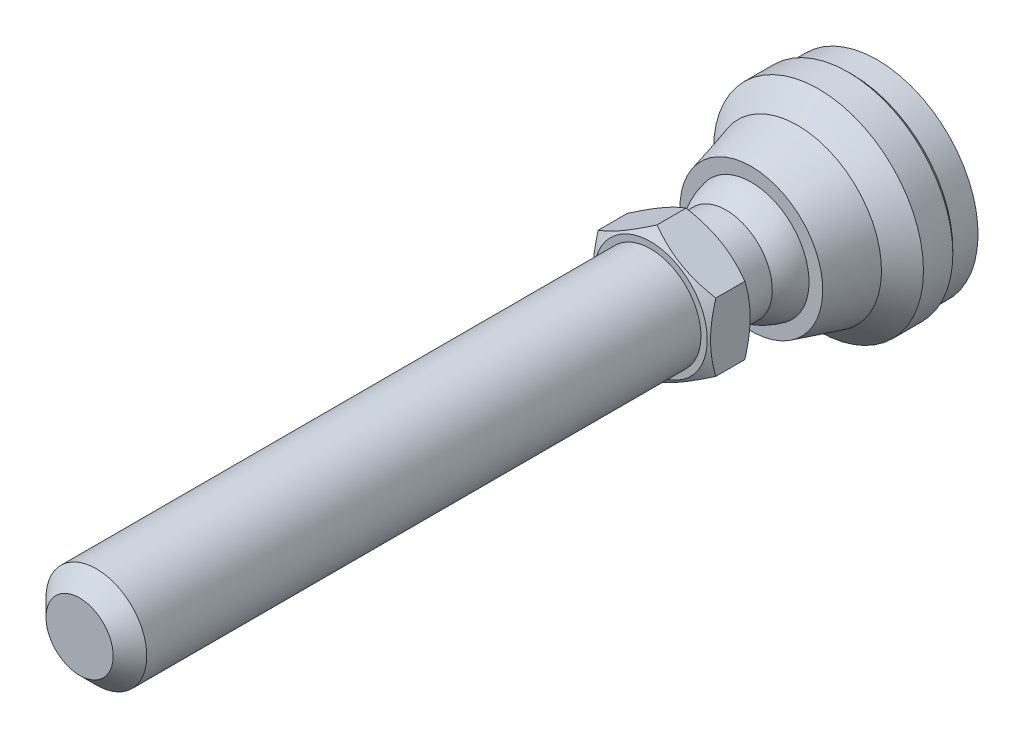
ISO-10303-21;
HEADER;
FILE_DESCRIPTION(('STEP AP214'),'2;1');
FILE_NAME('part.step','',(''),(''),'','','');
FILE_SCHEMA(('AUTOMOTIVE_DESIGN { 1 0 10303 214 1 1 1 1 }'));
ENDSEC;
DATA;
#1=APPLICATION_CONTEXT('core data for automotive mechanical design processes');
#2=APPLICATION_PROTOCOL_DEFINITION('international standard','automotive_design',2000,#1);
#3=PRODUCT_CONTEXT('',#1,'mechanical');
#4=PRODUCT('Part','Part','',(#3));
#5=PRODUCT_RELATED_PRODUCT_CATEGORY('part','',(#4));
#6=PRODUCT_DEFINITION_FORMATION('','',#4);
#7=PRODUCT_DEFINITION_CONTEXT('part definition',#1,'design');
#8=PRODUCT_DEFINITION('design','',#6,#7);
#9=PRODUCT_DEFINITION_SHAPE('','',#8);
#10=(LENGTH_UNIT() NAMED_UNIT(*) SI_UNIT(.MILLI.,.METRE.));
#11=(NAMED_UNIT(*) PLANE_ANGLE_UNIT() SI_UNIT($,.RADIAN.));
#12=(NAMED_UNIT(*) SI_UNIT($,.STERADIAN.) SOLID_ANGLE_UNIT());
#13=UNCERTAINTY_MEASURE_WITH_UNIT(LENGTH_MEASURE(1.E-05),#10,'distance_accuracy_value','');
#14=(GEOMETRIC_REPRESENTATION_CONTEXT(3) GLOBAL_UNCERTAINTY_ASSIGNED_CONTEXT((#13)) GLOBAL_UNIT_ASSIGNED_CONTEXT((#10,
#11,#12)) REPRESENTATION_CONTEXT('',''));
#15=CARTESIAN_POINT('',(0.,0.,0.));
#16=DIRECTION('',(0.,0.,1.));
#17=DIRECTION('',(1.,0.,0.));
#18=AXIS2_PLACEMENT_3D('',#15,#16,#17);
#19=CARTESIAN_POINT('',(-5.49999999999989,0.,21.9999999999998));
#20=DIRECTION('',(0.,0.,1.));
#21=DIRECTION('',(0.,-1.,0.));
#22=AXIS2_PLACEMENT_3D('',#19,#20,#21);
#23=PLANE('',#22);
#24=CARTESIAN_POINT('',(0.,0.,21.9999999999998));
#25=DIRECTION('',(0.,0.,1.));
#26=DIRECTION('',(0.,-1.,0.));
#27=AXIS2_PLACEMENT_3D('',#24,#25,#26);
#28=CIRCLE('',#27,6.75);
#29=CARTESIAN_POINT('',(0.,-6.75,21.9999999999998));
#30=VERTEX_POINT('',#29);
#31=EDGE_CURVE('E440',#30,#30,#28,.T.);
#32=ORIENTED_EDGE('',*,*,#31,.F.);
#33=EDGE_LOOP('',(#32));
#34=FACE_BOUND('',#33,.T.);
#35=CARTESIAN_POINT('',(0.,0.,21.9999999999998));
#36=DIRECTION('',(0.,0.,-1.));
#37=DIRECTION('',(0.,1.,0.));
#38=AXIS2_PLACEMENT_3D('',#35,#36,#37);
#39=CIRCLE('',#38,5.49999999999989);
#40=CARTESIAN_POINT('',(0.,5.49999999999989,21.9999999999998));
#41=VERTEX_POINT('',#40);
#42=EDGE_CURVE('E120',#41,#41,#39,.T.);
#43=ORIENTED_EDGE('',*,*,#42,.F.);
#44=EDGE_LOOP('',(#43));
#45=FACE_BOUND('',#44,.T.);
#46=ADVANCED_FACE('F14',(#34,#45),#23,.F.);
#47=CARTESIAN_POINT('',(0.,0.,0.));
#48=DIRECTION('',(0.,0.,-1.));
#49=DIRECTION('',(0.,1.,0.));
#50=AXIS2_PLACEMENT_3D('',#47,#48,#49);
#51=CYLINDRICAL_SURFACE('',#50,5.4999999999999);
#52=CARTESIAN_POINT('',(0.,0.,18.));
#53=DIRECTION('',(0.,0.,-1.));
#54=DIRECTION('',(0.,1.,0.));
#55=AXIS2_PLACEMENT_3D('',#52,#53,#54);
#56=CIRCLE('',#55,5.4999999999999);
#57=CARTESIAN_POINT('',(-5.49999999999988,0.,18.));
#58=VERTEX_POINT('',#57);
#59=EDGE_CURVE('E117',#58,#58,#56,.T.);
#60=ORIENTED_EDGE('',*,*,#59,.F.);
#61=EDGE_LOOP('',(#60));
#62=FACE_BOUND('',#61,.T.);
#63=ORIENTED_EDGE('',*,*,#42,.T.);
#64=EDGE_LOOP('',(#63));
#65=FACE_BOUND('',#64,.T.);
#66=ADVANCED_FACE('F144',(#62,#65),#51,.T.);
#67=CARTESIAN_POINT('',(1.11022302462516E-13,0.,13.6698729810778));
#68=DIRECTION('',(0.,0.,-1.));
#69=DIRECTION('',(-1.,0.,0.));
#70=AXIS2_PLACEMENT_3D('',#67,#68,#69);
#71=SPHERICAL_SURFACE('',#70,7.);
#72=CARTESIAN_POINT('',(0.,0.,15.));
#73=DIRECTION('',(0.,0.,-1.));
#74=DIRECTION('',(0.,1.,0.));
#75=AXIS2_PLACEMENT_3D('',#72,#73,#74);
#76=CIRCLE('',#75,6.87246404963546);
#77=CARTESIAN_POINT('',(-6.87246404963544,0.,15.));
#78=VERTEX_POINT('',#77);
#79=EDGE_CURVE('E114',#78,#78,#76,.T.);
#80=CARTESIAN_POINT('',(-6.87246404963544,0.,15.));
#81=CARTESIAN_POINT('',(-6.86587210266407,0.,15.0340591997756));
#82=CARTESIAN_POINT('',(-6.85902692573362,0.,15.0680693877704));
#83=CARTESIAN_POINT('',(-6.84483171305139,0.,15.1359842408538));
#84=CARTESIAN_POINT('',(-6.83748167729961,0.,15.1698889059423));
#85=CARTESIAN_POINT('',(-6.82227834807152,0.,15.2375852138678));
#86=CARTESIAN_POINT('',(-6.81442505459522,0.,15.2713768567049));
#87=CARTESIAN_POINT('',(-6.79821695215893,0.,15.3388396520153));
#88=CARTESIAN_POINT('',(-6.78986214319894,0.,15.3725108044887));
#89=CARTESIAN_POINT('',(-6.77265285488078,0.,15.4397251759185));
#90=CARTESIAN_POINT('',(-6.76379837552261,0.,15.473268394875));
#91=CARTESIAN_POINT('',(-6.7455917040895,0.,15.5402194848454));
#92=CARTESIAN_POINT('',(-6.73623951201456,0.,15.5736273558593));
#93=CARTESIAN_POINT('',(-6.71703948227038,0.,15.6403003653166));
#94=CARTESIAN_POINT('',(-6.70719164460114,0.,15.67356550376));
#95=CARTESIAN_POINT('',(-6.68700250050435,0.,15.7399456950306));
#96=CARTESIAN_POINT('',(-6.6766611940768,0.,15.7730607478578));
#97=CARTESIAN_POINT('',(-6.65548739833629,0.,15.8391334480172));
#98=CARTESIAN_POINT('',(-6.64465490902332,0.,15.8720910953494));
#99=CARTESIAN_POINT('',(-6.62250114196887,0.,15.9378416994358));
#100=CARTESIAN_POINT('',(-6.61117986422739,0.,15.9706346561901));
#101=CARTESIAN_POINT('',(-6.58805102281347,0.,16.0360486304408));
#102=CARTESIAN_POINT('',(-6.57624345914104,0.,16.0686696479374));
#103=CARTESIAN_POINT('',(-6.55214465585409,0.,16.1337325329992));
#104=CARTESIAN_POINT('',(-6.53985341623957,0.,16.1661744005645));
#105=CARTESIAN_POINT('',(-6.51478997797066,0.,16.2308718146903));
#106=CARTESIAN_POINT('',(-6.50201777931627,0.,16.2631273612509));
#107=CARTESIAN_POINT('',(-6.4759952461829,0.,16.3274450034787));
#108=CARTESIAN_POINT('',(-6.46274491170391,0.,16.3595070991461));
#109=CARTESIAN_POINT('',(-6.43576903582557,0.,16.4234307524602));
#110=CARTESIAN_POINT('',(-6.42204349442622,0.,16.455292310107));
#111=CARTESIAN_POINT('',(-6.3941202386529,0.,16.5188078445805));
#112=CARTESIAN_POINT('',(-6.37992252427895,0.,16.5504618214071));
#113=CARTESIAN_POINT('',(-6.3510580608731,0.,16.6135551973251));
#114=CARTESIAN_POINT('',(-6.33639131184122,0.,16.6449945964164));
#115=CARTESIAN_POINT('',(-6.3065920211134,0.,16.7076518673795));
#116=CARTESIAN_POINT('',(-6.29145947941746,0.,16.7388697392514));
#117=CARTESIAN_POINT('',(-6.26073194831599,0.,16.8010770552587));
#118=CARTESIAN_POINT('',(-6.24513695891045,0.,16.8320664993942));
#119=CARTESIAN_POINT('',(-6.21348797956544,0.,16.8938101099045));
#120=CARTESIAN_POINT('',(-6.19743398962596,0.,16.9245642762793));
#121=CARTESIAN_POINT('',(-6.16487055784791,0.,16.9858305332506));
#122=CARTESIAN_POINT('',(-6.14836111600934,0.,17.016342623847));
#123=CARTESIAN_POINT('',(-6.11489042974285,0.,17.0771179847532));
#124=CARTESIAN_POINT('',(-6.09792918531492,0.,17.107381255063));
#125=CARTESIAN_POINT('',(-6.06355864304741,0.,17.1676522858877));
#126=CARTESIAN_POINT('',(-6.04614934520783,0.,17.1976600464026));
#127=CARTESIAN_POINT('',(-6.01088654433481,0.,17.2574134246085));
#128=CARTESIAN_POINT('',(-5.99303304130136,0.,17.2871590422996));
#129=CARTESIAN_POINT('',(-5.95688577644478,0.,17.3463815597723));
#130=CARTESIAN_POINT('',(-5.93859201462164,0.,17.3758584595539));
#131=CARTESIAN_POINT('',(-5.9015682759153,0.,17.4345370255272));
#132=CARTESIAN_POINT('',(-5.88283829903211,0.,17.4637386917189));
#133=CARTESIAN_POINT('',(-5.8449462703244,0.,17.5218603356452));
#134=CARTESIAN_POINT('',(-5.82578421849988,0.,17.5507803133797));
#135=CARTESIAN_POINT('',(-5.7870322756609,0.,17.6083321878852));
#136=CARTESIAN_POINT('',(-5.76744238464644,0.,17.6369640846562));
#137=CARTESIAN_POINT('',(-5.72783909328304,0.,17.6939334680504));
#138=CARTESIAN_POINT('',(-5.7078256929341,0.,17.7222709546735));
#139=CARTESIAN_POINT('',(-5.66737980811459,0.,17.778645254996));
#140=CARTESIAN_POINT('',(-5.64694732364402,0.,17.8066820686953));
#141=CARTESIAN_POINT('',(-5.60566778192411,0.,17.862448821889));
#142=CARTESIAN_POINT('',(-5.58482072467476,0.,17.8901787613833));
#143=CARTESIAN_POINT('',(-5.54271666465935,0.,17.9453256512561));
#144=CARTESIAN_POINT('',(-5.52145966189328,0.,17.9727426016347));
#145=CARTESIAN_POINT('',(-5.49999999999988,0.,18.));
#146=B_SPLINE_CURVE_WITH_KNOTS('',3,(#80,#81,#82,#83,#84,#85,#86,#87,#88,#89,#90,#91,#92,#93,
#94,#95,#96,#97,#98,#99,#100,#101,#102,#103,#104,#105,#106,#107,#108,#109,#110,#111,#112,#113,
#114,#115,#116,#117,#118,#119,#120,#121,#122,#123,#124,#125,#126,#127,#128,#129,#130,#131,#132,
#133,#134,#135,#136,#137,#138,#139,#140,#141,#142,#143,#144,#145),.UNSPECIFIED.,.F.,.F.,(4,2,2,
2,2,2,2,2,2,2,2,2,2,2,2,2,2,2,2,2,2,2,2,2,2,2,2,2,2,2,2,2,4),(0.,0.104072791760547,
0.20814558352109,0.312218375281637,0.416291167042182,0.520363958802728,0.624436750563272,
0.728509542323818,0.832582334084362,0.936655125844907,1.04072791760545,1.144800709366,
1.24887350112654,1.35294629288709,1.45701908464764,1.56109187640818,1.66516466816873,
1.76923745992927,1.87331025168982,1.97738304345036,2.0814558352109,2.18552862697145,
2.289601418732,2.39367421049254,2.49774700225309,2.60181979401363,2.70589258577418,
2.80996537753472,2.91403816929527,3.01811096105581,3.12218375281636,3.2262565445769,
3.33032933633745),.UNSPECIFIED.);
#147=EDGE_CURVE('BSEAM151',#78,#58,#146,.T.);
#148=ORIENTED_EDGE('',*,*,#79,.F.);
#149=ORIENTED_EDGE('',*,*,#59,.T.);
#150=ORIENTED_EDGE('',*,*,#147,.T.);
#151=ORIENTED_EDGE('',*,*,#147,.F.);
#152=EDGE_LOOP('',(#148,#150,#149,#151));
#153=FACE_BOUND('',#152,.T.);
#154=ADVANCED_FACE('F151',(#153),#71,.T.);
#155=CARTESIAN_POINT('',(-8.5,0.,15.));
#156=DIRECTION('',(0.,0.,-1.));
#157=DIRECTION('',(0.,1.,0.));
#158=AXIS2_PLACEMENT_3D('',#155,#156,#157);
#159=PLANE('',#158);
#160=CARTESIAN_POINT('',(0.,0.,15.));
#161=DIRECTION('',(0.,0.,-1.));
#162=DIRECTION('',(0.,1.,0.));
#163=AXIS2_PLACEMENT_3D('',#160,#161,#162);
#164=CIRCLE('',#163,8.5);
#165=CARTESIAN_POINT('',(0.,8.5,15.));
#166=VERTEX_POINT('',#165);
#167=EDGE_CURVE('E111',#166,#166,#164,.T.);
#168=ORIENTED_EDGE('',*,*,#167,.F.);
#169=EDGE_LOOP('',(#168));
#170=FACE_BOUND('',#169,.T.);
#171=ORIENTED_EDGE('',*,*,#79,.T.);
#172=EDGE_LOOP('',(#171));
#173=FACE_BOUND('',#172,.T.);
#174=ADVANCED_FACE('F303',(#170,#173),#159,.F.);
#175=CARTESIAN_POINT('',(0.,0.,15.));
#176=DIRECTION('',(0.,0.,-1.));
#177=DIRECTION('',(0.,1.,0.));
#178=AXIS2_PLACEMENT_3D('',#175,#176,#177);
#179=CONICAL_SURFACE('',#178,8.5,0.266252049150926);
#180=CARTESIAN_POINT('',(0.,0.,9.5));
#181=DIRECTION('',(0.,0.,-1.));
#182=DIRECTION('',(0.,1.,0.));
#183=AXIS2_PLACEMENT_3D('',#180,#181,#182);
#184=CIRCLE('',#183,10.);
#185=CARTESIAN_POINT('',(0.,10.,9.5));
#186=VERTEX_POINT('',#185);
#187=EDGE_CURVE('E108',#186,#186,#184,.T.);
#188=ORIENTED_EDGE('',*,*,#187,.F.);
#189=EDGE_LOOP('',(#188));
#190=FACE_BOUND('',#189,.T.);
#191=ORIENTED_EDGE('',*,*,#167,.T.);
#192=EDGE_LOOP('',(#191));
#193=FACE_BOUND('',#192,.T.);
#194=ADVANCED_FACE('F293',(#190,#193),#179,.T.);
#195=CARTESIAN_POINT('',(0.,0.,9.5));
#196=DIRECTION('',(0.,0.,-1.));
#197=DIRECTION('',(0.,1.,0.));
#198=AXIS2_PLACEMENT_3D('',#195,#196,#197);
#199=CONICAL_SURFACE('',#198,10.,0.785398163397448);
#200=CARTESIAN_POINT('',(0.,0.,7.));
#201=DIRECTION('',(0.,0.,-1.));
#202=DIRECTION('',(0.,1.,0.));
#203=AXIS2_PLACEMENT_3D('',#200,#201,#202);
#204=CIRCLE('',#203,12.5);
#205=CARTESIAN_POINT('',(0.,12.5,7.));
#206=VERTEX_POINT('',#205);
#207=EDGE_CURVE('E105',#206,#206,#204,.T.);
#208=ORIENTED_EDGE('',*,*,#207,.F.);
#209=EDGE_LOOP('',(#208));
#210=FACE_BOUND('',#209,.T.);
#211=ORIENTED_EDGE('',*,*,#187,.T.);
#212=EDGE_LOOP('',(#211));
#213=FACE_BOUND('',#212,.T.);
#214=ADVANCED_FACE('F283',(#210,#213),#199,.T.);
#215=CARTESIAN_POINT('',(0.,0.,0.));
#216=DIRECTION('',(0.,0.,-1.));
#217=DIRECTION('',(0.,1.,0.));
#218=AXIS2_PLACEMENT_3D('',#215,#216,#217);
#219=CYLINDRICAL_SURFACE('',#218,12.5);
#220=CARTESIAN_POINT('',(0.,0.,3.5));
#221=DIRECTION('',(0.,0.,-1.));
#222=DIRECTION('',(0.,1.,0.));
#223=AXIS2_PLACEMENT_3D('',#220,#221,#222);
#224=CIRCLE('',#223,12.5);
#225=CARTESIAN_POINT('',(0.,12.5,3.5));
#226=VERTEX_POINT('',#225);
#227=EDGE_CURVE('E102',#226,#226,#224,.T.);
#228=ORIENTED_EDGE('',*,*,#227,.F.);
#229=EDGE_LOOP('',(#228));
#230=FACE_BOUND('',#229,.T.);
#231=ORIENTED_EDGE('',*,*,#207,.T.);
#232=EDGE_LOOP('',(#231));
#233=FACE_BOUND('',#232,.T.);
#234=ADVANCED_FACE('F273',(#230,#233),#219,.T.);
#235=CARTESIAN_POINT('',(0.,0.,3.5));
#236=DIRECTION('',(0.,0.,1.));
#237=DIRECTION('',(0.,-1.,0.));
#238=AXIS2_PLACEMENT_3D('',#235,#236,#237);
#239=CONICAL_SURFACE('',#238,12.5,0.785398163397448);
#240=CARTESIAN_POINT('',(0.,0.,3.));
#241=DIRECTION('',(0.,0.,-1.));
#242=DIRECTION('',(0.,1.,0.));
#243=AXIS2_PLACEMENT_3D('',#240,#241,#242);
#244=CIRCLE('',#243,12.);
#245=CARTESIAN_POINT('',(0.,12.,3.));
#246=VERTEX_POINT('',#245);
#247=EDGE_CURVE('E99',#246,#246,#244,.T.);
#248=ORIENTED_EDGE('',*,*,#247,.F.);
#249=EDGE_LOOP('',(#248));
#250=FACE_BOUND('',#249,.T.);
#251=ORIENTED_EDGE('',*,*,#227,.T.);
#252=EDGE_LOOP('',(#251));
#253=FACE_BOUND('',#252,.T.);
#254=ADVANCED_FACE('F263',(#250,#253),#239,.T.);
#255=CARTESIAN_POINT('',(0.,0.,0.));
#256=DIRECTION('',(0.,0.,-1.));
#257=DIRECTION('',(0.,1.,0.));
#258=AXIS2_PLACEMENT_3D('',#255,#256,#257);
#259=CYLINDRICAL_SURFACE('',#258,12.);
#260=CARTESIAN_POINT('',(0.,0.,0.));
#261=DIRECTION('',(0.,0.,-1.));
#262=DIRECTION('',(0.,1.,0.));
#263=AXIS2_PLACEMENT_3D('',#260,#261,#262);
#264=CIRCLE('',#263,12.);
#265=CARTESIAN_POINT('',(0.,12.,0.));
#266=VERTEX_POINT('',#265);
#267=EDGE_CURVE('E96',#266,#266,#264,.T.);
#268=ORIENTED_EDGE('',*,*,#267,.F.);
#269=EDGE_LOOP('',(#268));
#270=FACE_BOUND('',#269,.T.);
#271=ORIENTED_EDGE('',*,*,#247,.T.);
#272=EDGE_LOOP('',(#271));
#273=FACE_BOUND('',#272,.T.);
#274=ADVANCED_FACE('F252',(#270,#273),#259,.T.);
#275=CARTESIAN_POINT('',(-12.,0.,0.));
#276=DIRECTION('',(0.,0.,1.));
#277=DIRECTION('',(0.,-1.,0.));
#278=AXIS2_PLACEMENT_3D('',#275,#276,#277);
#279=PLANE('',#278);
#280=ORIENTED_EDGE('',*,*,#267,.T.);
#281=EDGE_LOOP('',(#280));
#282=FACE_BOUND('',#281,.T.);
#283=ADVANCED_FACE('F142',(#282),#279,.F.);
#284=CARTESIAN_POINT('',(0.,0.,21.9999999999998));
#285=DIRECTION('',(0.,0.,1.));
#286=DIRECTION('',(0.,-1.,0.));
#287=AXIS2_PLACEMENT_3D('',#284,#285,#286);
#288=CONICAL_SURFACE('',#287,6.75,1.0471975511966);
#289=CARTESIAN_POINT('',(0.000200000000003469,-8.0830192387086,22.7696190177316));
#290=CARTESIAN_POINT('',(-0.153667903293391,-7.99418356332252,22.7183374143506));
#291=CARTESIAN_POINT('',(-0.30810950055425,-7.90501666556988,22.6693831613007));
#292=CARTESIAN_POINT('',(-0.618246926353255,-7.72595873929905,22.5767703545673));
#293=CARTESIAN_POINT('',(-0.773943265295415,-7.63606741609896,22.5331140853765));
#294=CARTESIAN_POINT('',(-1.24352516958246,-7.36495417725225,22.4109491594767));
#295=CARTESIAN_POINT('',(-1.5592643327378,-7.18266208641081,22.3414631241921));
#296=CARTESIAN_POINT('',(-2.03176224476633,-6.90986528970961,22.2599825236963));
#297=CARTESIAN_POINT('',(-2.18710922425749,-6.82017566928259,22.2367710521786));
#298=CARTESIAN_POINT('',(-2.49850511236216,-6.64039116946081,22.1978487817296));
#299=CARTESIAN_POINT('',(-2.65455395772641,-6.55029632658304,22.1821373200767));
#300=CARTESIAN_POINT('',(-2.96692267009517,-6.36995016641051,22.1586154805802));
#301=CARTESIAN_POINT('',(-3.12324202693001,-6.27969914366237,22.15079613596));
#302=CARTESIAN_POINT('',(-3.43601650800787,-6.09911871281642,22.1432178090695));
#303=CARTESIAN_POINT('',(-3.59247162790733,-6.00878930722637,22.1434585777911));
#304=CARTESIAN_POINT('',(-4.02110687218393,-5.76131663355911,22.1551972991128));
#305=CARTESIAN_POINT('',(-4.2931466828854,-5.60425437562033,22.1749033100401));
#306=CARTESIAN_POINT('',(-4.83541944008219,-5.29117305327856,22.2373910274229));
#307=CARTESIAN_POINT('',(-5.10565047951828,-5.13515508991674,22.2801940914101));
#308=CARTESIAN_POINT('',(-5.64901454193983,-4.82144370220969,22.3871892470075));
#309=CARTESIAN_POINT('',(-5.92207900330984,-4.6637898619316,22.4518346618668));
#310=CARTESIAN_POINT('',(-6.46413578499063,-4.35083323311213,22.5985536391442));
#311=CARTESIAN_POINT('',(-6.73313504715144,-4.19552643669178,22.6805927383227));
#312=CARTESIAN_POINT('',(-7.0002,-4.04133641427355,22.7696190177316));
#313=B_SPLINE_CURVE_WITH_KNOTS('',3,(#289,#290,#291,#292,#293,#294,#295,#296,#297,#298,#299,
#300,#301,#302,#303,#304,#305,#306,#307,#308,#309,#310,#311,#312),.UNSPECIFIED.,.F.,.F.,(4,2,2,
2,2,2,2,2,2,2,2,4),(0.,0.554727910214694,1.10969417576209,2.2219327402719,2.76443041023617,
3.30688013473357,3.8487128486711,4.39052882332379,5.33376515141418,6.27787517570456,
7.24292418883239,8.20607866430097),.UNSPECIFIED.);
#314=CARTESIAN_POINT('',(0.,-8.08290376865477,22.7695523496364));
#315=VERTEX_POINT('',#314);
#316=CARTESIAN_POINT('',(-7.,-4.04145188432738,22.7695523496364));
#317=VERTEX_POINT('',#316);
#318=EDGE_CURVE('E73',#315,#317,#313,.T.);
#319=ORIENTED_EDGE('',*,*,#318,.T.);
#320=CARTESIAN_POINT('',(-7.,10.8403927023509,25.5530336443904));
#321=CARTESIAN_POINT('',(-7.,10.5347850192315,25.4048486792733));
#322=CARTESIAN_POINT('',(-7.,10.2284741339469,25.2580890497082));
#323=CARTESIAN_POINT('',(-7.,9.61407192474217,24.9682224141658));
#324=CARTESIAN_POINT('',(-7.,9.30598032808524,24.825115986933));
#325=CARTESIAN_POINT('',(-7.,8.68604788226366,24.5426344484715));
#326=CARTESIAN_POINT('',(-7.,8.37419574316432,24.4032840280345));
#327=CARTESIAN_POINT('',(-7.,7.74800573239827,24.1303065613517));
#328=CARTESIAN_POINT('',(-7.,7.43366797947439,23.9966792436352));
#329=CARTESIAN_POINT('',(-7.,6.79192161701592,23.7325081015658));
#330=CARTESIAN_POINT('',(-7.,6.46441596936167,23.6021987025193));
#331=CARTESIAN_POINT('',(-7.,5.80556817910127,23.351479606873));
#332=CARTESIAN_POINT('',(-7.,5.47422560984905,23.2310710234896));
#333=CARTESIAN_POINT('',(-7.,4.80779798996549,23.0033261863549));
#334=CARTESIAN_POINT('',(-7.,4.47272212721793,22.8959633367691));
#335=CARTESIAN_POINT('',(-7.,3.79777607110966,22.6977637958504));
#336=CARTESIAN_POINT('',(-7.,3.45790742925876,22.6069218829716));
#337=CARTESIAN_POINT('',(-7.,2.77500892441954,22.4466220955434));
#338=CARTESIAN_POINT('',(-7.,2.4320068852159,22.3770488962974));
#339=CARTESIAN_POINT('',(-7.,1.91439271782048,22.2916605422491));
#340=CARTESIAN_POINT('',(-7.,1.74132332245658,22.2663585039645));
#341=CARTESIAN_POINT('',(-7.,1.3943295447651,22.2225748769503));
#342=CARTESIAN_POINT('',(-7.,1.22040524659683,22.2040926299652));
#343=CARTESIAN_POINT('',(-7.,0.874200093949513,22.1745478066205));
#344=CARTESIAN_POINT('',(-7.,0.701927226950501,22.1633919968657));
#345=CARTESIAN_POINT('',(-7.,0.357064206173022,22.1483743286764));
#346=CARTESIAN_POINT('',(-7.,0.184474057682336,22.144512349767));
#347=CARTESIAN_POINT('',(-7.,-0.160715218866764,22.1441744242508));
#348=CARTESIAN_POINT('',(-7.,-0.33331434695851,22.1476985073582));
#349=CARTESIAN_POINT('',(-7.,-0.678211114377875,22.1620468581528));
#350=CARTESIAN_POINT('',(-7.,-0.850508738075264,22.1728714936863));
#351=CARTESIAN_POINT('',(-7.,-1.26505940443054,22.2074700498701));
#352=CARTESIAN_POINT('',(-7.,-1.50702727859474,22.2347337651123));
#353=CARTESIAN_POINT('',(-7.,-1.98914562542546,22.3021684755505));
#354=CARTESIAN_POINT('',(-7.,-2.22929584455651,22.3423412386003));
#355=CARTESIAN_POINT('',(-7.,-2.94675744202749,22.4800910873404));
#356=CARTESIAN_POINT('',(-7.,-3.42080785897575,22.5948740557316));
#357=CARTESIAN_POINT('',(-7.,-4.12962176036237,22.7936505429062));
#358=CARTESIAN_POINT('',(-7.,-4.36806851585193,22.8652630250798));
#359=CARTESIAN_POINT('',(-7.,-4.84264557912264,23.0158593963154));
#360=CARTESIAN_POINT('',(-7.,-5.07877587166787,23.0948433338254));
#361=CARTESIAN_POINT('',(-7.,-5.54879559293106,23.2589208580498));
#362=CARTESIAN_POINT('',(-7.,-5.78268574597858,23.3440123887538));
#363=CARTESIAN_POINT('',(-7.,-6.24853264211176,23.5193105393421));
#364=CARTESIAN_POINT('',(-7.,-6.48048940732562,23.6095171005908));
#365=CARTESIAN_POINT('',(-7.,-7.02582508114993,23.8274146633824));
#366=CARTESIAN_POINT('',(-7.,-7.33847882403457,23.95691714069));
#367=CARTESIAN_POINT('',(-7.,-7.96114673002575,24.2221375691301));
#368=CARTESIAN_POINT('',(-7.,-8.27116073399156,24.357855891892));
#369=CARTESIAN_POINT('',(-7.,-8.88903211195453,24.634265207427));
#370=CARTESIAN_POINT('',(-7.,-9.1968890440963,24.7749571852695));
#371=CARTESIAN_POINT('',(-7.,-9.81075516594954,25.0603230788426));
#372=CARTESIAN_POINT('',(-7.,-10.1167643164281,25.2049970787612));
#373=CARTESIAN_POINT('',(-7.,-10.7275525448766,25.4977342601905));
#374=CARTESIAN_POINT('',(-7.,-11.0323299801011,25.6458008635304));
#375=CARTESIAN_POINT('',(-7.,-11.6405755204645,25.9446018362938));
#376=CARTESIAN_POINT('',(-7.,-11.944043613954,26.0953362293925));
#377=CARTESIAN_POINT('',(-7.,-12.8527159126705,26.5507946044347));
#378=CARTESIAN_POINT('',(-7.,-13.4562687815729,26.8588127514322));
#379=CARTESIAN_POINT('',(-7.,-14.6099893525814,27.4550992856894));
#380=CARTESIAN_POINT('',(-7.,-15.1604134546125,27.7428737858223));
#381=CARTESIAN_POINT('',(-7.,-16.2592155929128,28.3223461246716));
#382=CARTESIAN_POINT('',(-7.,-16.8075935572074,28.6140440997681));
#383=CARTESIAN_POINT('',(-7.,-17.9014010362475,29.199706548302));
#384=CARTESIAN_POINT('',(-7.,-18.4468344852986,29.4936636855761));
#385=CARTESIAN_POINT('',(-7.,-19.5363921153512,30.0839247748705));
#386=CARTESIAN_POINT('',(-7.,-20.0805163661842,30.380228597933));
#387=CARTESIAN_POINT('',(-7.,-20.6241582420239,30.6774089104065));
#388=B_SPLINE_CURVE_WITH_KNOTS('',3,(#320,#321,#322,#323,#324,#325,#326,#327,#328,#329,#330,
#331,#332,#333,#334,#335,#336,#337,#338,#339,#340,#341,#342,#343,#344,#345,#346,#347,#348,#349,
#350,#351,#352,#353,#354,#355,#356,#357,#358,#359,#360,#361,#362,#363,#364,#365,#366,#367,#368,
#369,#370,#371,#372,#373,#374,#375,#376,#377,#378,#379,#380,#381,#382,#383,#384,#385,#386,#387),
.UNSPECIFIED.,.F.,.F.,(4,2,2,2,2,2,2,2,2,2,2,2,2,2,2,2,2,2,2,2,2,2,2,2,2,2,2,2,2,2,2,2,2,4),(0.,
1.0189303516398,2.03802113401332,3.06268607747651,4.08730236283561,5.14461108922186,
6.20203853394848,7.2572727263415,8.31217282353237,9.36124713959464,9.88586134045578,
10.4104248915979,10.9281765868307,11.445919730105,11.9636649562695,12.4814362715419,
13.211520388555,13.9417045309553,15.4028884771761,16.1497317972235,16.8965800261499,
17.6431780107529,18.3897674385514,19.4049155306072,20.4201243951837,21.435535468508,
22.4509680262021,23.4674742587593,24.4839895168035,26.5167513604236,28.3800722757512,
30.2434581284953,32.1022623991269,33.9609652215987),.UNSPECIFIED.);
#389=CARTESIAN_POINT('',(-7.,4.04145188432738,22.7695523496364));
#390=VERTEX_POINT('',#389);
#391=EDGE_CURVE('E81',#317,#390,#388,.F.);
#392=ORIENTED_EDGE('',*,*,#391,.T.);
#393=CARTESIAN_POINT('',(-7.0002,4.04133641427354,22.7696190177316));
#394=CARTESIAN_POINT('',(-6.84633209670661,4.13017208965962,22.7183374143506));
#395=CARTESIAN_POINT('',(-6.69189049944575,4.21933898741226,22.6693831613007));
#396=CARTESIAN_POINT('',(-6.38175307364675,4.39839691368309,22.5767703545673));
#397=CARTESIAN_POINT('',(-6.22605673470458,4.48828823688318,22.5331140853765));
#398=CARTESIAN_POINT('',(-5.75647483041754,4.75940147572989,22.4109491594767));
#399=CARTESIAN_POINT('',(-5.4407356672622,4.94169356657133,22.3414631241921));
#400=CARTESIAN_POINT('',(-4.96823775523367,5.21449036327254,22.2599825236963));
#401=CARTESIAN_POINT('',(-4.81289077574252,5.30417998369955,22.2367710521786));
#402=CARTESIAN_POINT('',(-4.50149488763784,5.48396448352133,22.1978487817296));
#403=CARTESIAN_POINT('',(-4.34544604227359,5.57405932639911,22.1821373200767));
#404=CARTESIAN_POINT('',(-4.03307732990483,5.75440548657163,22.1586154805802));
#405=CARTESIAN_POINT('',(-3.87675797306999,5.84465650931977,22.15079613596));
#406=CARTESIAN_POINT('',(-3.56398349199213,6.02523694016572,22.1432178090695));
#407=CARTESIAN_POINT('',(-3.40752837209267,6.11556634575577,22.1434585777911));
#408=CARTESIAN_POINT('',(-2.97889312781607,6.36303901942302,22.1551972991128));
#409=CARTESIAN_POINT('',(-2.7068533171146,6.52010127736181,22.1749033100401));
#410=CARTESIAN_POINT('',(-2.16458055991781,6.83318259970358,22.2373910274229));
#411=CARTESIAN_POINT('',(-1.89434952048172,6.9892005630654,22.2801940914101));
#412=CARTESIAN_POINT('',(-1.35098545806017,7.30291195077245,22.3871892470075));
#413=CARTESIAN_POINT('',(-1.07792099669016,7.46056579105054,22.4518346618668));
#414=CARTESIAN_POINT('',(-0.535864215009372,7.77352241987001,22.5985536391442));
#415=CARTESIAN_POINT('',(-0.266864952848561,7.92882921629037,22.6805927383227));
#416=CARTESIAN_POINT('',(0.00019999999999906,8.0830192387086,22.7696190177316));
#417=B_SPLINE_CURVE_WITH_KNOTS('',3,(#393,#394,#395,#396,#397,#398,#399,#400,#401,#402,#403,
#404,#405,#406,#407,#408,#409,#410,#411,#412,#413,#414,#415,#416),.UNSPECIFIED.,.F.,.F.,(4,2,2,
2,2,2,2,2,2,2,2,4),(0.,0.554727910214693,1.10969417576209,2.2219327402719,2.76443041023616,
3.30688013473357,3.84871284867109,4.39052882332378,5.33376515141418,6.27787517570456,
7.2429241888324,8.20607866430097),.UNSPECIFIED.);
#418=CARTESIAN_POINT('',(0.,8.08290376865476,22.7695523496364));
#419=VERTEX_POINT('',#418);
#420=EDGE_CURVE('E395',#390,#419,#417,.T.);
#421=ORIENTED_EDGE('',*,*,#420,.T.);
#422=CARTESIAN_POINT('',(-0.000200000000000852,8.0830192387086,22.7696190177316));
#423=CARTESIAN_POINT('',(0.15366790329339,7.99418356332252,22.7183374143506));
#424=CARTESIAN_POINT('',(0.308109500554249,7.90501666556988,22.6693831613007));
#425=CARTESIAN_POINT('',(0.618246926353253,7.72595873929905,22.5767703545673));
#426=CARTESIAN_POINT('',(0.773943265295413,7.63606741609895,22.5331140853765));
#427=CARTESIAN_POINT('',(1.24352516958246,7.36495417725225,22.4109491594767));
#428=CARTESIAN_POINT('',(1.5592643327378,7.18266208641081,22.3414631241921));
#429=CARTESIAN_POINT('',(2.03176224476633,6.9098652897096,22.2599825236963));
#430=CARTESIAN_POINT('',(2.18710922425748,6.82017566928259,22.2367710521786));
#431=CARTESIAN_POINT('',(2.49850511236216,6.64039116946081,22.1978487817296));
#432=CARTESIAN_POINT('',(2.65455395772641,6.55029632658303,22.1821373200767));
#433=CARTESIAN_POINT('',(2.96692267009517,6.36995016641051,22.1586154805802));
#434=CARTESIAN_POINT('',(3.12324202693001,6.27969914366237,22.15079613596));
#435=CARTESIAN_POINT('',(3.43601650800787,6.09911871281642,22.1432178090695));
#436=CARTESIAN_POINT('',(3.59247162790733,6.00878930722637,22.1434585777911));
#437=CARTESIAN_POINT('',(4.02110687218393,5.76131663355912,22.1551972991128));
#438=CARTESIAN_POINT('',(4.2931466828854,5.60425437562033,22.1749033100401));
#439=CARTESIAN_POINT('',(4.83541944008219,5.29117305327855,22.2373910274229));
#440=CARTESIAN_POINT('',(5.10565047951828,5.13515508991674,22.2801940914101));
#441=CARTESIAN_POINT('',(5.64901454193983,4.82144370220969,22.3871892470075));
#442=CARTESIAN_POINT('',(5.92207900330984,4.66378986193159,22.4518346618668));
#443=CARTESIAN_POINT('',(6.46413578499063,4.35083323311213,22.5985536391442));
#444=CARTESIAN_POINT('',(6.73313504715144,4.19552643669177,22.6805927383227));
#445=CARTESIAN_POINT('',(7.0002,4.04133641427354,22.7696190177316));
#446=B_SPLINE_CURVE_WITH_KNOTS('',3,(#422,#423,#424,#425,#426,#427,#428,#429,#430,#431,#432,
#433,#434,#435,#436,#437,#438,#439,#440,#441,#442,#443,#444,#445),.UNSPECIFIED.,.F.,.F.,(4,2,2,
2,2,2,2,2,2,2,2,4),(0.,0.554727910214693,1.10969417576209,2.2219327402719,2.76443041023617,
3.30688013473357,3.8487128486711,4.39052882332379,5.33376515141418,6.27787517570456,
7.2429241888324,8.20607866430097),.UNSPECIFIED.);
#447=CARTESIAN_POINT('',(7.,4.04145188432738,22.7695523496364));
#448=VERTEX_POINT('',#447);
#449=EDGE_CURVE('E390',#419,#448,#446,.T.);
#450=ORIENTED_EDGE('',*,*,#449,.T.);
#451=CARTESIAN_POINT('',(7.,10.8403927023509,25.5530336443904));
#452=CARTESIAN_POINT('',(7.,10.5347850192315,25.4048486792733));
#453=CARTESIAN_POINT('',(7.,10.2284741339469,25.2580890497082));
#454=CARTESIAN_POINT('',(7.,9.61407192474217,24.9682224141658));
#455=CARTESIAN_POINT('',(7.,9.30598032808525,24.825115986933));
#456=CARTESIAN_POINT('',(7.,8.68604788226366,24.5426344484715));
#457=CARTESIAN_POINT('',(7.,8.37419574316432,24.4032840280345));
#458=CARTESIAN_POINT('',(7.,7.74800573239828,24.1303065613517));
#459=CARTESIAN_POINT('',(7.,7.43366797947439,23.9966792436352));
#460=CARTESIAN_POINT('',(7.,6.79192161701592,23.7325081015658));
#461=CARTESIAN_POINT('',(7.,6.46441596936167,23.6021987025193));
#462=CARTESIAN_POINT('',(7.,5.80556817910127,23.351479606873));
#463=CARTESIAN_POINT('',(7.,5.47422560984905,23.2310710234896));
#464=CARTESIAN_POINT('',(7.,4.8077979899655,23.0033261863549));
#465=CARTESIAN_POINT('',(7.,4.47272212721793,22.8959633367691));
#466=CARTESIAN_POINT('',(7.,3.79777607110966,22.6977637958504));
#467=CARTESIAN_POINT('',(7.,3.45790742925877,22.6069218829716));
#468=CARTESIAN_POINT('',(7.,2.77500892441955,22.4466220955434));
#469=CARTESIAN_POINT('',(7.,2.4320068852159,22.3770488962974));
#470=CARTESIAN_POINT('',(7.,1.91439271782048,22.2916605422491));
#471=CARTESIAN_POINT('',(7.,1.74132332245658,22.2663585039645));
#472=CARTESIAN_POINT('',(7.,1.3943295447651,22.2225748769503));
#473=CARTESIAN_POINT('',(7.,1.22040524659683,22.2040926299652));
#474=CARTESIAN_POINT('',(7.,0.874200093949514,22.1745478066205));
#475=CARTESIAN_POINT('',(7.,0.701927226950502,22.1633919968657));
#476=CARTESIAN_POINT('',(7.,0.357064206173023,22.1483743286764));
#477=CARTESIAN_POINT('',(7.,0.184474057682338,22.144512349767));
#478=CARTESIAN_POINT('',(7.,-0.160715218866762,22.1441744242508));
#479=CARTESIAN_POINT('',(7.,-0.333314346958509,22.1476985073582));
#480=CARTESIAN_POINT('',(7.,-0.678211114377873,22.1620468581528));
#481=CARTESIAN_POINT('',(7.,-0.850508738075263,22.1728714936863));
#482=CARTESIAN_POINT('',(7.,-1.26505940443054,22.2074700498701));
#483=CARTESIAN_POINT('',(7.,-1.50702727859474,22.2347337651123));
#484=CARTESIAN_POINT('',(7.,-1.98914562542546,22.3021684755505));
#485=CARTESIAN_POINT('',(7.,-2.22929584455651,22.3423412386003));
#486=CARTESIAN_POINT('',(7.,-2.94675744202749,22.4800910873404));
#487=CARTESIAN_POINT('',(7.,-3.42080785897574,22.5948740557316));
#488=CARTESIAN_POINT('',(7.,-4.12962176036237,22.7936505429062));
#489=CARTESIAN_POINT('',(7.,-4.36806851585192,22.8652630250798));
#490=CARTESIAN_POINT('',(7.,-4.84264557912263,23.0158593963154));
#491=CARTESIAN_POINT('',(7.,-5.07877587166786,23.0948433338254));
#492=CARTESIAN_POINT('',(7.,-5.54879559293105,23.2589208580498));
#493=CARTESIAN_POINT('',(7.,-5.78268574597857,23.3440123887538));
#494=CARTESIAN_POINT('',(7.,-6.24853264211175,23.5193105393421));
#495=CARTESIAN_POINT('',(7.,-6.48048940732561,23.6095171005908));
#496=CARTESIAN_POINT('',(7.,-7.02582508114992,23.8274146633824));
#497=CARTESIAN_POINT('',(7.,-7.33847882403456,23.95691714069));
#498=CARTESIAN_POINT('',(7.,-7.96114673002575,24.2221375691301));
#499=CARTESIAN_POINT('',(7.,-8.27116073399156,24.357855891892));
#500=CARTESIAN_POINT('',(7.,-8.88903211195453,24.634265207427));
#501=CARTESIAN_POINT('',(7.,-9.1968890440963,24.7749571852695));
#502=CARTESIAN_POINT('',(7.,-9.81075516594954,25.0603230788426));
#503=CARTESIAN_POINT('',(7.,-10.1167643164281,25.2049970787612));
#504=CARTESIAN_POINT('',(7.,-10.7275525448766,25.4977342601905));
#505=CARTESIAN_POINT('',(7.,-11.0323299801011,25.6458008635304));
#506=CARTESIAN_POINT('',(7.,-11.6405755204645,25.9446018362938));
#507=CARTESIAN_POINT('',(7.,-11.944043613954,26.0953362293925));
#508=CARTESIAN_POINT('',(7.,-12.8527159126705,26.5507946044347));
#509=CARTESIAN_POINT('',(7.,-13.4562687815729,26.8588127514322));
#510=CARTESIAN_POINT('',(7.,-14.6099893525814,27.4550992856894));
#511=CARTESIAN_POINT('',(7.,-15.1604134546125,27.7428737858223));
#512=CARTESIAN_POINT('',(7.,-16.2592155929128,28.3223461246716));
#513=CARTESIAN_POINT('',(7.,-16.8075935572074,28.6140440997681));
#514=CARTESIAN_POINT('',(7.,-17.9014010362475,29.199706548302));
#515=CARTESIAN_POINT('',(7.,-18.4468344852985,29.4936636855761));
#516=CARTESIAN_POINT('',(7.,-19.5363921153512,30.0839247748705));
#517=CARTESIAN_POINT('',(7.,-20.0805163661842,30.380228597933));
#518=CARTESIAN_POINT('',(7.,-20.6241582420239,30.6774089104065));
#519=B_SPLINE_CURVE_WITH_KNOTS('',3,(#451,#452,#453,#454,#455,#456,#457,#458,#459,#460,#461,
#462,#463,#464,#465,#466,#467,#468,#469,#470,#471,#472,#473,#474,#475,#476,#477,#478,#479,#480,
#481,#482,#483,#484,#485,#486,#487,#488,#489,#490,#491,#492,#493,#494,#495,#496,#497,#498,#499,
#500,#501,#502,#503,#504,#505,#506,#507,#508,#509,#510,#511,#512,#513,#514,#515,#516,#517,#518),
.UNSPECIFIED.,.F.,.F.,(4,2,2,2,2,2,2,2,2,2,2,2,2,2,2,2,2,2,2,2,2,2,2,2,2,2,2,2,2,2,2,2,2,4),(0.,
1.0189303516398,2.03802113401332,3.06268607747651,4.08730236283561,5.14461108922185,
6.20203853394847,7.2572727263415,8.31217282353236,9.36124713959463,9.88586134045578,
10.4104248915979,10.9281765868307,11.445919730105,11.9636649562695,12.4814362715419,
13.211520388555,13.9417045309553,15.4028884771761,16.1497317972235,16.8965800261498,
17.6431780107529,18.3897674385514,19.4049155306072,20.4201243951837,21.435535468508,
22.4509680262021,23.4674742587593,24.4839895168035,26.5167513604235,28.3800722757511,
30.2434581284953,32.1022623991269,33.9609652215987),.UNSPECIFIED.);
#520=CARTESIAN_POINT('',(7.,-4.04145188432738,22.7695523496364));
#521=VERTEX_POINT('',#520);
#522=EDGE_CURVE('E34',#448,#521,#519,.T.);
#523=ORIENTED_EDGE('',*,*,#522,.T.);
#524=CARTESIAN_POINT('',(7.0002,-4.04133641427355,22.7696190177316));
#525=CARTESIAN_POINT('',(6.84633209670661,-4.13017208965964,22.7183374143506));
#526=CARTESIAN_POINT('',(6.69189049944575,-4.21933898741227,22.6693831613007));
#527=CARTESIAN_POINT('',(6.38175307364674,-4.3983969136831,22.5767703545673));
#528=CARTESIAN_POINT('',(6.22605673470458,-4.4882882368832,22.5331140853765));
#529=CARTESIAN_POINT('',(5.75647483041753,-4.7594014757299,22.4109491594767));
#530=CARTESIAN_POINT('',(5.4407356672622,-4.94169356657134,22.3414631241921));
#531=CARTESIAN_POINT('',(4.96823775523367,-5.21449036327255,22.2599825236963));
#532=CARTESIAN_POINT('',(4.81289077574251,-5.30417998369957,22.2367710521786));
#533=CARTESIAN_POINT('',(4.50149488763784,-5.48396448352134,22.1978487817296));
#534=CARTESIAN_POINT('',(4.34544604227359,-5.57405932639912,22.1821373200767));
#535=CARTESIAN_POINT('',(4.03307732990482,-5.75440548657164,22.1586154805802));
#536=CARTESIAN_POINT('',(3.87675797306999,-5.84465650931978,22.15079613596));
#537=CARTESIAN_POINT('',(3.56398349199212,-6.02523694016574,22.1432178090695));
#538=CARTESIAN_POINT('',(3.40752837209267,-6.11556634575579,22.1434585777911));
#539=CARTESIAN_POINT('',(2.97889312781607,-6.36303901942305,22.1551972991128));
#540=CARTESIAN_POINT('',(2.7068533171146,-6.52010127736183,22.1749033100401));
#541=CARTESIAN_POINT('',(2.1645805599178,-6.83318259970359,22.2373910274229));
#542=CARTESIAN_POINT('',(1.89434952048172,-6.98920056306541,22.2801940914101));
#543=CARTESIAN_POINT('',(1.35098545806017,-7.30291195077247,22.3871892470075));
#544=CARTESIAN_POINT('',(1.07792099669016,-7.46056579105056,22.4518346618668));
#545=CARTESIAN_POINT('',(0.535864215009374,-7.77352241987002,22.5985536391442));
#546=CARTESIAN_POINT('',(0.266864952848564,-7.92882921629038,22.6805927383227));
#547=CARTESIAN_POINT('',(-0.000199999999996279,-8.08301923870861,22.7696190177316));
#548=B_SPLINE_CURVE_WITH_KNOTS('',3,(#524,#525,#526,#527,#528,#529,#530,#531,#532,#533,#534,
#535,#536,#537,#538,#539,#540,#541,#542,#543,#544,#545,#546,#547),.UNSPECIFIED.,.F.,.F.,(4,2,2,
2,2,2,2,2,2,2,2,4),(0.,0.554727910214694,1.10969417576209,2.2219327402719,2.76443041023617,
3.30688013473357,3.8487128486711,4.39052882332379,5.33376515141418,6.27787517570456,
7.24292418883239,8.20607866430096),.UNSPECIFIED.);
#549=EDGE_CURVE('E9',#521,#315,#548,.T.);
#550=ORIENTED_EDGE('',*,*,#549,.T.);
#551=EDGE_LOOP('',(#319,#392,#421,#450,#523,#550));
#552=FACE_BOUND('',#551,.T.);
#553=ORIENTED_EDGE('',*,*,#31,.T.);
#554=EDGE_LOOP('',(#553));
#555=FACE_BOUND('',#554,.T.);
#556=ADVANCED_FACE('F71',(#552,#555),#288,.T.);
#557=CARTESIAN_POINT('',(-3.99999999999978,0.,95.));
#558=DIRECTION('',(0.,0.,-1.));
#559=DIRECTION('',(0.,1.,0.));
#560=AXIS2_PLACEMENT_3D('',#557,#558,#559);
#561=PLANE('',#560);
#562=CARTESIAN_POINT('',(0.,0.,95.));
#563=DIRECTION('',(0.,0.,-1.));
#564=DIRECTION('',(0.,1.,0.));
#565=AXIS2_PLACEMENT_3D('',#562,#563,#564);
#566=CIRCLE('',#565,3.99999999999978);
#567=CARTESIAN_POINT('',(0.,3.99999999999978,95.));
#568=VERTEX_POINT('',#567);
#569=EDGE_CURVE('E28',#568,#568,#566,.T.);
#570=ORIENTED_EDGE('',*,*,#569,.F.);
#571=EDGE_LOOP('',(#570));
#572=FACE_BOUND('',#571,.T.);
#573=ADVANCED_FACE('F16',(#572),#561,.F.);
#574=CARTESIAN_POINT('',(0.,0.,95.));
#575=DIRECTION('',(0.,0.,-1.));
#576=DIRECTION('',(0.,1.,0.));
#577=AXIS2_PLACEMENT_3D('',#574,#575,#576);
#578=CONICAL_SURFACE('',#577,3.99999999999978,0.785398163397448);
#579=CARTESIAN_POINT('',(0.,0.,93.));
#580=DIRECTION('',(0.,0.,-1.));
#581=DIRECTION('',(0.,1.,0.));
#582=AXIS2_PLACEMENT_3D('',#579,#580,#581);
#583=CIRCLE('',#582,5.99999999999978);
#584=CARTESIAN_POINT('',(0.,5.99999999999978,93.));
#585=VERTEX_POINT('',#584);
#586=EDGE_CURVE('E126',#585,#585,#583,.T.);
#587=ORIENTED_EDGE('',*,*,#586,.F.);
#588=EDGE_LOOP('',(#587));
#589=FACE_BOUND('',#588,.T.);
#590=ORIENTED_EDGE('',*,*,#569,.T.);
#591=EDGE_LOOP('',(#590));
#592=FACE_BOUND('',#591,.T.);
#593=ADVANCED_FACE('F131',(#589,#592),#578,.T.);
#594=CARTESIAN_POINT('',(0.,0.,0.));
#595=DIRECTION('',(0.,0.,-1.));
#596=DIRECTION('',(0.,1.,0.));
#597=AXIS2_PLACEMENT_3D('',#594,#595,#596);
#598=CYLINDRICAL_SURFACE('',#597,5.99999999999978);
#599=CARTESIAN_POINT('',(0.,0.,27.));
#600=DIRECTION('',(0.,0.,-1.));
#601=DIRECTION('',(0.,1.,0.));
#602=AXIS2_PLACEMENT_3D('',#599,#600,#601);
#603=CIRCLE('',#602,5.99999999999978);
#604=CARTESIAN_POINT('',(0.,5.99999999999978,27.));
#605=VERTEX_POINT('',#604);
#606=EDGE_CURVE('E123',#605,#605,#603,.T.);
#607=ORIENTED_EDGE('',*,*,#606,.F.);
#608=EDGE_LOOP('',(#607));
#609=FACE_BOUND('',#608,.T.);
#610=ORIENTED_EDGE('',*,*,#586,.T.);
#611=EDGE_LOOP('',(#610));
#612=FACE_BOUND('',#611,.T.);
#613=ADVANCED_FACE('F140',(#609,#612),#598,.T.);
#614=CARTESIAN_POINT('',(-5.99999999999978,0.,27.));
#615=DIRECTION('',(0.,0.,-1.));
#616=DIRECTION('',(0.,1.,0.));
#617=AXIS2_PLACEMENT_3D('',#614,#615,#616);
#618=PLANE('',#617);
#619=CARTESIAN_POINT('',(0.,0.,27.));
#620=DIRECTION('',(0.,0.,1.));
#621=DIRECTION('',(0.,-1.,0.));
#622=AXIS2_PLACEMENT_3D('',#619,#620,#621);
#623=CIRCLE('',#622,6.75);
#624=CARTESIAN_POINT('',(0.,-6.75,27.));
#625=VERTEX_POINT('',#624);
#626=EDGE_CURVE('E80',#625,#625,#623,.T.);
#627=ORIENTED_EDGE('',*,*,#626,.T.);
#628=EDGE_LOOP('',(#627));
#629=FACE_BOUND('',#628,.T.);
#630=ORIENTED_EDGE('',*,*,#606,.T.);
#631=EDGE_LOOP('',(#630));
#632=FACE_BOUND('',#631,.T.);
#633=ADVANCED_FACE('F158',(#629,#632),#618,.F.);
#634=CARTESIAN_POINT('',(0.,0.,25.2109254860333));
#635=DIRECTION('',(0.,0.,-1.));
#636=DIRECTION('',(0.,1.,0.));
#637=AXIS2_PLACEMENT_3D('',#634,#635,#636);
#638=CONICAL_SURFACE('',#637,9.84876795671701,1.0471975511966);
#639=CARTESIAN_POINT('',(-7.0002,-4.04133641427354,26.2303809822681));
#640=CARTESIAN_POINT('',(-6.84633209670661,-4.13017208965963,26.2816625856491));
#641=CARTESIAN_POINT('',(-6.69189049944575,-4.21933898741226,26.330616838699));
#642=CARTESIAN_POINT('',(-6.38175307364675,-4.3983969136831,26.4232296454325));
#643=CARTESIAN_POINT('',(-6.22605673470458,-4.48828823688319,26.4668859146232));
#644=CARTESIAN_POINT('',(-5.75647483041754,-4.7594014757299,26.5890508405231));
#645=CARTESIAN_POINT('',(-5.4407356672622,-4.94169356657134,26.6585368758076));
#646=CARTESIAN_POINT('',(-4.96823775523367,-5.21449036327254,26.7400174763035));
#647=CARTESIAN_POINT('',(-4.81289077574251,-5.30417998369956,26.7632289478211));
#648=CARTESIAN_POINT('',(-4.50149488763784,-5.48396448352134,26.8021512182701));
#649=CARTESIAN_POINT('',(-4.34544604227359,-5.57405932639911,26.8178626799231));
#650=CARTESIAN_POINT('',(-4.03307732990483,-5.75440548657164,26.8413845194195));
#651=CARTESIAN_POINT('',(-3.87675797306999,-5.84465650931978,26.8492038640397));
#652=CARTESIAN_POINT('',(-3.56398349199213,-6.02523694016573,26.8567821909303));
#653=CARTESIAN_POINT('',(-3.40752837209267,-6.11556634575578,26.8565414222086));
#654=CARTESIAN_POINT('',(-2.97889312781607,-6.36303901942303,26.844802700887));
#655=CARTESIAN_POINT('',(-2.7068533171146,-6.52010127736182,26.8250966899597));
#656=CARTESIAN_POINT('',(-2.1645805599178,-6.83318259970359,26.7626089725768));
#657=CARTESIAN_POINT('',(-1.89434952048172,-6.9892005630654,26.7198059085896));
#658=CARTESIAN_POINT('',(-1.35098545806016,-7.30291195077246,26.6128107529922));
#659=CARTESIAN_POINT('',(-1.07792099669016,-7.46056579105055,26.5481653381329));
#660=CARTESIAN_POINT('',(-0.535864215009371,-7.77352241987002,26.4014463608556));
#661=CARTESIAN_POINT('',(-0.266864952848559,-7.92882921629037,26.319407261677));
#662=CARTESIAN_POINT('',(0.000200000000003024,-8.0830192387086,26.2303809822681));
#663=B_SPLINE_CURVE_WITH_KNOTS('',3,(#639,#640,#641,#642,#643,#644,#645,#646,#647,#648,#649,
#650,#651,#652,#653,#654,#655,#656,#657,#658,#659,#660,#661,#662),.UNSPECIFIED.,.F.,.F.,(4,2,2,
2,2,2,2,2,2,2,2,4),(0.,0.554727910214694,1.10969417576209,2.2219327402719,2.76443041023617,
3.30688013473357,3.8487128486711,4.39052882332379,5.33376515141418,6.27787517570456,
7.2429241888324,8.20607866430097),.UNSPECIFIED.);
#664=CARTESIAN_POINT('',(-7.,-4.04145188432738,26.2304476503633));
#665=VERTEX_POINT('',#664);
#666=CARTESIAN_POINT('',(0.,-8.08290376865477,26.2304476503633));
#667=VERTEX_POINT('',#666);
#668=EDGE_CURVE('E88',#665,#667,#663,.T.);
#669=ORIENTED_EDGE('',*,*,#668,.T.);
#670=CARTESIAN_POINT('',(-0.000199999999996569,-8.08301923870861,26.2303809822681));
#671=CARTESIAN_POINT('',(0.153667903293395,-7.99418356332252,26.2816625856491));
#672=CARTESIAN_POINT('',(0.308109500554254,-7.90501666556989,26.330616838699));
#673=CARTESIAN_POINT('',(0.618246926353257,-7.72595873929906,26.4232296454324));
#674=CARTESIAN_POINT('',(0.773943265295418,-7.63606741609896,26.4668859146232));
#675=CARTESIAN_POINT('',(1.24352516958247,-7.36495417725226,26.5890508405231));
#676=CARTESIAN_POINT('',(1.5592643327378,-7.18266208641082,26.6585368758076));
#677=CARTESIAN_POINT('',(2.03176224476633,-6.90986528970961,26.7400174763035));
#678=CARTESIAN_POINT('',(2.18710922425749,-6.8201756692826,26.7632289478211));
#679=CARTESIAN_POINT('',(2.49850511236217,-6.64039116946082,26.8021512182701));
#680=CARTESIAN_POINT('',(2.65455395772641,-6.55029632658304,26.8178626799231));
#681=CARTESIAN_POINT('',(2.96692267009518,-6.36995016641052,26.8413845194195));
#682=CARTESIAN_POINT('',(3.12324202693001,-6.27969914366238,26.8492038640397));
#683=CARTESIAN_POINT('',(3.43601650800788,-6.09911871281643,26.8567821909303));
#684=CARTESIAN_POINT('',(3.59247162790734,-6.00878930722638,26.8565414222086));
#685=CARTESIAN_POINT('',(4.02110687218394,-5.76131663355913,26.844802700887));
#686=CARTESIAN_POINT('',(4.2931466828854,-5.60425437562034,26.8250966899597));
#687=CARTESIAN_POINT('',(4.8354194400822,-5.29117305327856,26.7626089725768));
#688=CARTESIAN_POINT('',(5.10565047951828,-5.13515508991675,26.7198059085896));
#689=CARTESIAN_POINT('',(5.64901454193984,-4.8214437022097,26.6128107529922));
#690=CARTESIAN_POINT('',(5.92207900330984,-4.6637898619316,26.5481653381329));
#691=CARTESIAN_POINT('',(6.46413578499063,-4.35083323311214,26.4014463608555));
#692=CARTESIAN_POINT('',(6.73313504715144,-4.19552643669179,26.319407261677));
#693=CARTESIAN_POINT('',(7.0002,-4.04133641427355,26.2303809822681));
#694=B_SPLINE_CURVE_WITH_KNOTS('',3,(#670,#671,#672,#673,#674,#675,#676,#677,#678,#679,#680,
#681,#682,#683,#684,#685,#686,#687,#688,#689,#690,#691,#692,#693),.UNSPECIFIED.,.F.,.F.,(4,2,2,
2,2,2,2,2,2,2,2,4),(0.,0.554727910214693,1.10969417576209,2.2219327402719,2.76443041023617,
3.30688013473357,3.84871284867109,4.39052882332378,5.33376515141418,6.27787517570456,
7.24292418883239,8.20607866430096),.UNSPECIFIED.);
#695=CARTESIAN_POINT('',(7.,-4.04145188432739,26.2304476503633));
#696=VERTEX_POINT('',#695);
#697=EDGE_CURVE('E86',#667,#696,#694,.T.);
#698=ORIENTED_EDGE('',*,*,#697,.T.);
#699=CARTESIAN_POINT('',(7.,10.8403927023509,23.4469663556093));
#700=CARTESIAN_POINT('',(7.,10.5347850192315,23.5951513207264));
#701=CARTESIAN_POINT('',(7.,10.2284741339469,23.7419109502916));
#702=CARTESIAN_POINT('',(7.,9.61407192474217,24.0317775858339));
#703=CARTESIAN_POINT('',(7.,9.30598032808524,24.1748840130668));
#704=CARTESIAN_POINT('',(7.,8.68604788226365,24.4573655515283));
#705=CARTESIAN_POINT('',(7.,8.37419574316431,24.5967159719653));
#706=CARTESIAN_POINT('',(7.,7.74800573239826,24.869693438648));
#707=CARTESIAN_POINT('',(7.,7.43366797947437,25.0033207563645));
#708=CARTESIAN_POINT('',(7.,6.7919216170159,25.267491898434));
#709=CARTESIAN_POINT('',(7.,6.46441596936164,25.3978012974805));
#710=CARTESIAN_POINT('',(7.,5.80556817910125,25.6485203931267));
#711=CARTESIAN_POINT('',(7.,5.47422560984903,25.7689289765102));
#712=CARTESIAN_POINT('',(7.,4.80779798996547,25.9966738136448));
#713=CARTESIAN_POINT('',(7.,4.47272212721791,26.1040366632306));
#714=CARTESIAN_POINT('',(7.,3.79777607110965,26.3022362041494));
#715=CARTESIAN_POINT('',(7.,3.45790742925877,26.3930781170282));
#716=CARTESIAN_POINT('',(7.,2.77500892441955,26.5533779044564));
#717=CARTESIAN_POINT('',(7.,2.4320068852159,26.6229511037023));
#718=CARTESIAN_POINT('',(7.,1.91439271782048,26.7083394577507));
#719=CARTESIAN_POINT('',(7.,1.74132332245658,26.7336414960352));
#720=CARTESIAN_POINT('',(7.,1.39432954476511,26.7774251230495));
#721=CARTESIAN_POINT('',(7.,1.22040524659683,26.7959073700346));
#722=CARTESIAN_POINT('',(7.,0.874200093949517,26.8254521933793));
#723=CARTESIAN_POINT('',(7.,0.701927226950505,26.836608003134));
#724=CARTESIAN_POINT('',(7.,0.357064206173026,26.8516256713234));
#725=CARTESIAN_POINT('',(7.,0.18447405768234,26.8554876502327));
#726=CARTESIAN_POINT('',(7.,-0.160715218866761,26.8558255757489));
#727=CARTESIAN_POINT('',(7.,-0.333314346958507,26.8523014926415));
#728=CARTESIAN_POINT('',(7.,-0.678211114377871,26.837953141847));
#729=CARTESIAN_POINT('',(7.,-0.850508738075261,26.8271285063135));
#730=CARTESIAN_POINT('',(7.,-1.26505940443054,26.7925299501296));
#731=CARTESIAN_POINT('',(7.,-1.50702727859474,26.7652662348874));
#732=CARTESIAN_POINT('',(7.,-1.98914562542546,26.6978315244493));
#733=CARTESIAN_POINT('',(7.,-2.22929584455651,26.6576587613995));
#734=CARTESIAN_POINT('',(7.,-2.94675744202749,26.5199089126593));
#735=CARTESIAN_POINT('',(7.,-3.42080785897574,26.4051259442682));
#736=CARTESIAN_POINT('',(7.,-4.12962176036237,26.2063494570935));
#737=CARTESIAN_POINT('',(7.,-4.36806851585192,26.1347369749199));
#738=CARTESIAN_POINT('',(7.,-4.84264557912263,25.9841406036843));
#739=CARTESIAN_POINT('',(7.,-5.07877587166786,25.9051566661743));
#740=CARTESIAN_POINT('',(7.,-5.54879559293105,25.7410791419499));
#741=CARTESIAN_POINT('',(7.,-5.78268574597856,25.6559876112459));
#742=CARTESIAN_POINT('',(7.,-6.24853264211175,25.4806894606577));
#743=CARTESIAN_POINT('',(7.,-6.48048940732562,25.390482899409));
#744=CARTESIAN_POINT('',(7.,-7.02582508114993,25.1725853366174));
#745=CARTESIAN_POINT('',(7.,-7.33847882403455,25.0430828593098));
#746=CARTESIAN_POINT('',(7.,-7.96114673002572,24.7778624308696));
#747=CARTESIAN_POINT('',(7.,-8.27116073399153,24.6421441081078));
#748=CARTESIAN_POINT('',(7.,-8.8890321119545,24.3657347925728));
#749=CARTESIAN_POINT('',(7.,-9.19688904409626,24.2250428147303));
#750=CARTESIAN_POINT('',(7.,-9.8107551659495,23.9396769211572));
#751=CARTESIAN_POINT('',(7.,-10.1167643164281,23.7950029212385));
#752=CARTESIAN_POINT('',(7.,-10.7275525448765,23.5022657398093));
#753=CARTESIAN_POINT('',(7.,-11.032329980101,23.3541991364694));
#754=CARTESIAN_POINT('',(7.,-11.6405755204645,23.055398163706));
#755=CARTESIAN_POINT('',(7.,-11.944043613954,22.9046637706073));
#756=CARTESIAN_POINT('',(7.,-12.8527159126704,22.4492053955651));
#757=CARTESIAN_POINT('',(7.,-13.4562687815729,22.1411872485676));
#758=CARTESIAN_POINT('',(7.,-14.6099893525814,21.5449007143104));
#759=CARTESIAN_POINT('',(7.,-15.1604134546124,21.2571262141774));
#760=CARTESIAN_POINT('',(7.,-16.2592155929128,20.6776538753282));
#761=CARTESIAN_POINT('',(7.,-16.8075935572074,20.3859559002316));
#762=CARTESIAN_POINT('',(7.,-17.9014010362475,19.8002934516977));
#763=CARTESIAN_POINT('',(7.,-18.4468344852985,19.5063363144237));
#764=CARTESIAN_POINT('',(7.,-19.5363921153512,18.9160752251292));
#765=CARTESIAN_POINT('',(7.,-20.0805163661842,18.6197714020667));
#766=CARTESIAN_POINT('',(7.,-20.6241582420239,18.3225910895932));
#767=B_SPLINE_CURVE_WITH_KNOTS('',3,(#699,#700,#701,#702,#703,#704,#705,#706,#707,#708,#709,
#710,#711,#712,#713,#714,#715,#716,#717,#718,#719,#720,#721,#722,#723,#724,#725,#726,#727,#728,
#729,#730,#731,#732,#733,#734,#735,#736,#737,#738,#739,#740,#741,#742,#743,#744,#745,#746,#747,
#748,#749,#750,#751,#752,#753,#754,#755,#756,#757,#758,#759,#760,#761,#762,#763,#764,#765,#766),
.UNSPECIFIED.,.F.,.F.,(4,2,2,2,2,2,2,2,2,2,2,2,2,2,2,2,2,2,2,2,2,2,2,2,2,2,2,2,2,2,2,2,2,4),(0.,
1.0189303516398,2.03802113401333,3.06268607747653,4.08730236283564,5.14461108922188,
6.2020385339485,7.25727272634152,8.31217282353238,9.36124713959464,9.88586134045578,
10.4104248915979,10.9281765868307,11.445919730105,11.9636649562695,12.4814362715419,
13.211520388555,13.9417045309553,15.4028884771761,16.1497317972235,16.8965800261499,
17.6431780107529,18.3897674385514,19.4049155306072,20.4201243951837,21.435535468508,
22.450968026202,23.4674742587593,24.4839895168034,26.5167513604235,28.3800722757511,
30.2434581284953,32.1022623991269,33.9609652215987),.UNSPECIFIED.);
#768=CARTESIAN_POINT('',(7.,4.04145188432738,26.2304476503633));
#769=VERTEX_POINT('',#768);
#770=EDGE_CURVE('E435',#696,#769,#767,.F.);
#771=ORIENTED_EDGE('',*,*,#770,.T.);
#772=CARTESIAN_POINT('',(7.0002,4.04133641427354,26.2303809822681));
#773=CARTESIAN_POINT('',(6.84633209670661,4.13017208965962,26.2816625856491));
#774=CARTESIAN_POINT('',(6.69189049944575,4.21933898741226,26.330616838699));
#775=CARTESIAN_POINT('',(6.38175307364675,4.39839691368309,26.4232296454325));
#776=CARTESIAN_POINT('',(6.22605673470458,4.48828823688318,26.4668859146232));
#777=CARTESIAN_POINT('',(5.75647483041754,4.75940147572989,26.5890508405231));
#778=CARTESIAN_POINT('',(5.4407356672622,4.94169356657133,26.6585368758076));
#779=CARTESIAN_POINT('',(4.96823775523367,5.21449036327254,26.7400174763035));
#780=CARTESIAN_POINT('',(4.81289077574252,5.30417998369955,26.7632289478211));
#781=CARTESIAN_POINT('',(4.50149488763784,5.48396448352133,26.8021512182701));
#782=CARTESIAN_POINT('',(4.34544604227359,5.57405932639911,26.8178626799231));
#783=CARTESIAN_POINT('',(4.03307732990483,5.75440548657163,26.8413845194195));
#784=CARTESIAN_POINT('',(3.87675797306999,5.84465650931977,26.8492038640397));
#785=CARTESIAN_POINT('',(3.56398349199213,6.02523694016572,26.8567821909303));
#786=CARTESIAN_POINT('',(3.40752837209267,6.11556634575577,26.8565414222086));
#787=CARTESIAN_POINT('',(2.97889312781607,6.36303901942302,26.844802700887));
#788=CARTESIAN_POINT('',(2.7068533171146,6.52010127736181,26.8250966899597));
#789=CARTESIAN_POINT('',(2.16458055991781,6.83318259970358,26.7626089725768));
#790=CARTESIAN_POINT('',(1.89434952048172,6.9892005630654,26.7198059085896));
#791=CARTESIAN_POINT('',(1.35098545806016,7.30291195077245,26.6128107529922));
#792=CARTESIAN_POINT('',(1.07792099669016,7.46056579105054,26.5481653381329));
#793=CARTESIAN_POINT('',(0.535864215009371,7.77352241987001,26.4014463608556));
#794=CARTESIAN_POINT('',(0.26686495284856,7.92882921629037,26.319407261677));
#795=CARTESIAN_POINT('',(-0.00020000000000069,8.0830192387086,26.2303809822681));
#796=B_SPLINE_CURVE_WITH_KNOTS('',3,(#772,#773,#774,#775,#776,#777,#778,#779,#780,#781,#782,
#783,#784,#785,#786,#787,#788,#789,#790,#791,#792,#793,#794,#795),.UNSPECIFIED.,.F.,.F.,(4,2,2,
2,2,2,2,2,2,2,2,4),(0.,0.554727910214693,1.10969417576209,2.2219327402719,2.76443041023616,
3.30688013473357,3.84871284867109,4.39052882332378,5.33376515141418,6.27787517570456,
7.2429241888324,8.20607866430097),.UNSPECIFIED.);
#797=CARTESIAN_POINT('',(0.,8.08290376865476,26.2304476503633));
#798=VERTEX_POINT('',#797);
#799=EDGE_CURVE('E412',#769,#798,#796,.T.);
#800=ORIENTED_EDGE('',*,*,#799,.T.);
#801=CARTESIAN_POINT('',(0.000199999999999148,8.0830192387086,26.2303809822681));
#802=CARTESIAN_POINT('',(-0.153667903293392,7.99418356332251,26.2816625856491));
#803=CARTESIAN_POINT('',(-0.308109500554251,7.90501666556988,26.330616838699));
#804=CARTESIAN_POINT('',(-0.618246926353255,7.72595873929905,26.4232296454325));
#805=CARTESIAN_POINT('',(-0.773943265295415,7.63606741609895,26.4668859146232));
#806=CARTESIAN_POINT('',(-1.24352516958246,7.36495417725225,26.5890508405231));
#807=CARTESIAN_POINT('',(-1.5592643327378,7.18266208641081,26.6585368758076));
#808=CARTESIAN_POINT('',(-2.03176224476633,6.9098652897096,26.7400174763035));
#809=CARTESIAN_POINT('',(-2.18710922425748,6.82017566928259,26.7632289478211));
#810=CARTESIAN_POINT('',(-2.49850511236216,6.64039116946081,26.8021512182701));
#811=CARTESIAN_POINT('',(-2.65455395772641,6.55029632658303,26.8178626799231));
#812=CARTESIAN_POINT('',(-2.96692267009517,6.36995016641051,26.8413845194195));
#813=CARTESIAN_POINT('',(-3.12324202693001,6.27969914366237,26.8492038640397));
#814=CARTESIAN_POINT('',(-3.43601650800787,6.09911871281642,26.8567821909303));
#815=CARTESIAN_POINT('',(-3.59247162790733,6.00878930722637,26.8565414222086));
#816=CARTESIAN_POINT('',(-4.02110687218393,5.76131663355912,26.844802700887));
#817=CARTESIAN_POINT('',(-4.2931466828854,5.60425437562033,26.8250966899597));
#818=CARTESIAN_POINT('',(-4.83541944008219,5.29117305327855,26.7626089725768));
#819=CARTESIAN_POINT('',(-5.10565047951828,5.13515508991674,26.7198059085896));
#820=CARTESIAN_POINT('',(-5.64901454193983,4.82144370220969,26.6128107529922));
#821=CARTESIAN_POINT('',(-5.92207900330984,4.66378986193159,26.5481653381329));
#822=CARTESIAN_POINT('',(-6.46413578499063,4.35083323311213,26.4014463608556));
#823=CARTESIAN_POINT('',(-6.73313504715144,4.19552643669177,26.319407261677));
#824=CARTESIAN_POINT('',(-7.0002,4.04133641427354,26.2303809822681));
#825=B_SPLINE_CURVE_WITH_KNOTS('',3,(#801,#802,#803,#804,#805,#806,#807,#808,#809,#810,#811,
#812,#813,#814,#815,#816,#817,#818,#819,#820,#821,#822,#823,#824),.UNSPECIFIED.,.F.,.F.,(4,2,2,
2,2,2,2,2,2,2,2,4),(0.,0.554727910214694,1.10969417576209,2.2219327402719,2.76443041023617,
3.30688013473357,3.84871284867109,4.39052882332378,5.33376515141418,6.27787517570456,
7.2429241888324,8.20607866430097),.UNSPECIFIED.);
#826=CARTESIAN_POINT('',(-7.,4.04145188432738,26.2304476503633));
#827=VERTEX_POINT('',#826);
#828=EDGE_CURVE('E405',#798,#827,#825,.T.);
#829=ORIENTED_EDGE('',*,*,#828,.T.);
#830=CARTESIAN_POINT('',(-7.,10.8403927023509,23.4469663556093));
#831=CARTESIAN_POINT('',(-7.,10.5347850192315,23.5951513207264));
#832=CARTESIAN_POINT('',(-7.,10.2284741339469,23.7419109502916));
#833=CARTESIAN_POINT('',(-7.,9.61407192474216,24.0317775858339));
#834=CARTESIAN_POINT('',(-7.,9.30598032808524,24.1748840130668));
#835=CARTESIAN_POINT('',(-7.,8.68604788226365,24.4573655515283));
#836=CARTESIAN_POINT('',(-7.,8.37419574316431,24.5967159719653));
#837=CARTESIAN_POINT('',(-7.,7.74800573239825,24.869693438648));
#838=CARTESIAN_POINT('',(-7.,7.43366797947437,25.0033207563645));
#839=CARTESIAN_POINT('',(-7.,6.79192161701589,25.267491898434));
#840=CARTESIAN_POINT('',(-7.,6.46441596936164,25.3978012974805));
#841=CARTESIAN_POINT('',(-7.,5.80556817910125,25.6485203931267));
#842=CARTESIAN_POINT('',(-7.,5.47422560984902,25.7689289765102));
#843=CARTESIAN_POINT('',(-7.,4.80779798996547,25.9966738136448));
#844=CARTESIAN_POINT('',(-7.,4.4727221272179,26.1040366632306));
#845=CARTESIAN_POINT('',(-7.,3.79777607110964,26.3022362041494));
#846=CARTESIAN_POINT('',(-7.,3.45790742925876,26.3930781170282));
#847=CARTESIAN_POINT('',(-7.,2.77500892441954,26.5533779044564));
#848=CARTESIAN_POINT('',(-7.,2.43200688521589,26.6229511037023));
#849=CARTESIAN_POINT('',(-7.,1.91439271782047,26.7083394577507));
#850=CARTESIAN_POINT('',(-7.,1.74132332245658,26.7336414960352));
#851=CARTESIAN_POINT('',(-7.,1.3943295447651,26.7774251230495));
#852=CARTESIAN_POINT('',(-7.,1.22040524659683,26.7959073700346));
#853=CARTESIAN_POINT('',(-7.,0.874200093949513,26.8254521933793));
#854=CARTESIAN_POINT('',(-7.,0.701927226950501,26.836608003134));
#855=CARTESIAN_POINT('',(-7.,0.357064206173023,26.8516256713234));
#856=CARTESIAN_POINT('',(-7.,0.184474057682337,26.8554876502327));
#857=CARTESIAN_POINT('',(-7.,-0.160715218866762,26.8558255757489));
#858=CARTESIAN_POINT('',(-7.,-0.333314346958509,26.8523014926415));
#859=CARTESIAN_POINT('',(-7.,-0.678211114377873,26.837953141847));
#860=CARTESIAN_POINT('',(-7.,-0.850508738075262,26.8271285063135));
#861=CARTESIAN_POINT('',(-7.,-1.26505940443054,26.7925299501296));
#862=CARTESIAN_POINT('',(-7.,-1.50702727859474,26.7652662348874));
#863=CARTESIAN_POINT('',(-7.,-1.98914562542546,26.6978315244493));
#864=CARTESIAN_POINT('',(-7.,-2.22929584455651,26.6576587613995));
#865=CARTESIAN_POINT('',(-7.,-2.94675744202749,26.5199089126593));
#866=CARTESIAN_POINT('',(-7.,-3.42080785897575,26.4051259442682));
#867=CARTESIAN_POINT('',(-7.,-4.12962176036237,26.2063494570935));
#868=CARTESIAN_POINT('',(-7.,-4.36806851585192,26.1347369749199));
#869=CARTESIAN_POINT('',(-7.,-4.84264557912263,25.9841406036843));
#870=CARTESIAN_POINT('',(-7.,-5.07877587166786,25.9051566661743));
#871=CARTESIAN_POINT('',(-7.,-5.54879559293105,25.7410791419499));
#872=CARTESIAN_POINT('',(-7.,-5.78268574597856,25.6559876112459));
#873=CARTESIAN_POINT('',(-7.,-6.24853264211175,25.4806894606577));
#874=CARTESIAN_POINT('',(-7.,-6.48048940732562,25.390482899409));
#875=CARTESIAN_POINT('',(-7.,-7.02582508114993,25.1725853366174));
#876=CARTESIAN_POINT('',(-7.,-7.33847882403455,25.0430828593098));
#877=CARTESIAN_POINT('',(-7.,-7.96114673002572,24.7778624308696));
#878=CARTESIAN_POINT('',(-7.,-8.27116073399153,24.6421441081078));
#879=CARTESIAN_POINT('',(-7.,-8.8890321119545,24.3657347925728));
#880=CARTESIAN_POINT('',(-7.,-9.19688904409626,24.2250428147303));
#881=CARTESIAN_POINT('',(-7.,-9.81075516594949,23.9396769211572));
#882=CARTESIAN_POINT('',(-7.,-10.1167643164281,23.7950029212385));
#883=CARTESIAN_POINT('',(-7.,-10.7275525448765,23.5022657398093));
#884=CARTESIAN_POINT('',(-7.,-11.032329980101,23.3541991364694));
#885=CARTESIAN_POINT('',(-7.,-11.6405755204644,23.055398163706));
#886=CARTESIAN_POINT('',(-7.,-11.9440436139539,22.9046637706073));
#887=CARTESIAN_POINT('',(-7.,-12.8527159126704,22.4492053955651));
#888=CARTESIAN_POINT('',(-7.,-13.4562687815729,22.1411872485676));
#889=CARTESIAN_POINT('',(-7.,-14.6099893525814,21.5449007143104));
#890=CARTESIAN_POINT('',(-7.,-15.1604134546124,21.2571262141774));
#891=CARTESIAN_POINT('',(-7.,-16.2592155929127,20.6776538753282));
#892=CARTESIAN_POINT('',(-7.,-16.8075935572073,20.3859559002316));
#893=CARTESIAN_POINT('',(-7.,-17.9014010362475,19.8002934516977));
#894=CARTESIAN_POINT('',(-7.,-18.4468344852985,19.5063363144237));
#895=CARTESIAN_POINT('',(-7.,-19.5363921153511,18.9160752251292));
#896=CARTESIAN_POINT('',(-7.,-20.0805163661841,18.6197714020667));
#897=CARTESIAN_POINT('',(-7.,-20.6241582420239,18.3225910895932));
#898=B_SPLINE_CURVE_WITH_KNOTS('',3,(#830,#831,#832,#833,#834,#835,#836,#837,#838,#839,#840,
#841,#842,#843,#844,#845,#846,#847,#848,#849,#850,#851,#852,#853,#854,#855,#856,#857,#858,#859,
#860,#861,#862,#863,#864,#865,#866,#867,#868,#869,#870,#871,#872,#873,#874,#875,#876,#877,#878,
#879,#880,#881,#882,#883,#884,#885,#886,#887,#888,#889,#890,#891,#892,#893,#894,#895,#896,#897),
.UNSPECIFIED.,.F.,.F.,(4,2,2,2,2,2,2,2,2,2,2,2,2,2,2,2,2,2,2,2,2,2,2,2,2,2,2,2,2,2,2,2,2,4),(0.,
1.0189303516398,2.03802113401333,3.06268607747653,4.08730236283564,5.14461108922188,
6.2020385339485,7.25727272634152,8.31217282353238,9.36124713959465,9.88586134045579,
10.4104248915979,10.9281765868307,11.445919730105,11.9636649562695,12.4814362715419,
13.211520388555,13.9417045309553,15.4028884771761,16.1497317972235,16.8965800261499,
17.6431780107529,18.3897674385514,19.4049155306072,20.4201243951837,21.435535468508,
22.450968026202,23.4674742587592,24.4839895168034,26.5167513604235,28.3800722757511,
30.2434581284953,32.1022623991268,33.9609652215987),.UNSPECIFIED.);
#899=EDGE_CURVE('E92',#827,#665,#898,.T.);
#900=ORIENTED_EDGE('',*,*,#899,.T.);
#901=EDGE_LOOP('',(#669,#698,#771,#800,#829,#900));
#902=FACE_BOUND('',#901,.T.);
#903=ORIENTED_EDGE('',*,*,#626,.F.);
#904=EDGE_LOOP('',(#903));
#905=FACE_BOUND('',#904,.T.);
#906=ADVANCED_FACE('F161',(#902,#905),#638,.T.);
#907=CARTESIAN_POINT('',(0.,-8.08290376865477,21.9999999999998));
#908=DIRECTION('',(0.5,-0.866025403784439,0.));
#909=DIRECTION('',(0.866025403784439,0.5,0.));
#910=AXIS2_PLACEMENT_3D('',#907,#908,#909);
#911=PLANE('',#910);
#912=ORIENTED_EDGE('',*,*,#549,.F.);
#913=DIRECTION('',(0.,0.,1.));
#914=VECTOR('',#913,1.);
#915=CARTESIAN_POINT('',(7.,-4.04145188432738,21.9999999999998));
#916=LINE('',#915,#914);
#917=EDGE_CURVE('E87',#521,#696,#916,.T.);
#918=ORIENTED_EDGE('',*,*,#917,.T.);
#919=ORIENTED_EDGE('',*,*,#697,.F.);
#920=DIRECTION('',(0.,0.,1.));
#921=VECTOR('',#920,1.);
#922=CARTESIAN_POINT('',(0.,-8.08290376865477,21.9999999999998));
#923=LINE('',#922,#921);
#924=EDGE_CURVE('E42',#315,#667,#923,.T.);
#925=ORIENTED_EDGE('',*,*,#924,.F.);
#926=EDGE_LOOP('',(#912,#918,#919,#925));
#927=FACE_BOUND('',#926,.T.);
#928=ADVANCED_FACE('F84',(#927),#911,.T.);
#929=CARTESIAN_POINT('',(7.,-4.04145188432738,21.9999999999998));
#930=DIRECTION('',(1.,0.,0.));
#931=DIRECTION('',(0.,1.,0.));
#932=AXIS2_PLACEMENT_3D('',#929,#930,#931);
#933=PLANE('',#932);
#934=ORIENTED_EDGE('',*,*,#522,.F.);
#935=DIRECTION('',(0.,0.,1.));
#936=VECTOR('',#935,1.);
#937=CARTESIAN_POINT('',(7.,4.04145188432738,21.9999999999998));
#938=LINE('',#937,#936);
#939=EDGE_CURVE('E90',#448,#769,#938,.T.);
#940=ORIENTED_EDGE('',*,*,#939,.T.);
#941=ORIENTED_EDGE('',*,*,#770,.F.);
#942=ORIENTED_EDGE('',*,*,#917,.F.);
#943=EDGE_LOOP('',(#934,#940,#941,#942));
#944=FACE_BOUND('',#943,.T.);
#945=ADVANCED_FACE('F199',(#944),#933,.T.);
#946=CARTESIAN_POINT('',(7.,4.04145188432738,21.9999999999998));
#947=DIRECTION('',(0.5,0.866025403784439,0.));
#948=DIRECTION('',(-0.866025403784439,0.5,0.));
#949=AXIS2_PLACEMENT_3D('',#946,#947,#948);
#950=PLANE('',#949);
#951=ORIENTED_EDGE('',*,*,#449,.F.);
#952=DIRECTION('',(0.,0.,1.));
#953=VECTOR('',#952,1.);
#954=CARTESIAN_POINT('',(0.,8.08290376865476,21.9999999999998));
#955=LINE('',#954,#953);
#956=EDGE_CURVE('E429',#419,#798,#955,.T.);
#957=ORIENTED_EDGE('',*,*,#956,.T.);
#958=ORIENTED_EDGE('',*,*,#799,.F.);
#959=ORIENTED_EDGE('',*,*,#939,.F.);
#960=EDGE_LOOP('',(#951,#957,#958,#959));
#961=FACE_BOUND('',#960,.T.);
#962=ADVANCED_FACE('F206',(#961),#950,.T.);
#963=CARTESIAN_POINT('',(0.,8.08290376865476,21.9999999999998));
#964=DIRECTION('',(-0.5,0.866025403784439,0.));
#965=DIRECTION('',(-0.866025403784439,-0.5,0.));
#966=AXIS2_PLACEMENT_3D('',#963,#964,#965);
#967=PLANE('',#966);
#968=ORIENTED_EDGE('',*,*,#420,.F.);
#969=DIRECTION('',(0.,0.,1.));
#970=VECTOR('',#969,1.);
#971=CARTESIAN_POINT('',(-7.,4.04145188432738,21.9999999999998));
#972=LINE('',#971,#970);
#973=EDGE_CURVE('E428',#390,#827,#972,.T.);
#974=ORIENTED_EDGE('',*,*,#973,.T.);
#975=ORIENTED_EDGE('',*,*,#828,.F.);
#976=ORIENTED_EDGE('',*,*,#956,.F.);
#977=EDGE_LOOP('',(#968,#974,#975,#976));
#978=FACE_BOUND('',#977,.T.);
#979=ADVANCED_FACE('F215',(#978),#967,.T.);
#980=CARTESIAN_POINT('',(-7.,4.04145188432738,21.9999999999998));
#981=DIRECTION('',(-1.,0.,0.));
#982=DIRECTION('',(0.,-1.,0.));
#983=AXIS2_PLACEMENT_3D('',#980,#981,#982);
#984=PLANE('',#983);
#985=ORIENTED_EDGE('',*,*,#391,.F.);
#986=DIRECTION('',(0.,0.,1.));
#987=VECTOR('',#986,1.);
#988=CARTESIAN_POINT('',(-7.,-4.04145188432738,21.9999999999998));
#989=LINE('',#988,#987);
#990=EDGE_CURVE('E79',#317,#665,#989,.T.);
#991=ORIENTED_EDGE('',*,*,#990,.T.);
#992=ORIENTED_EDGE('',*,*,#899,.F.);
#993=ORIENTED_EDGE('',*,*,#973,.F.);
#994=EDGE_LOOP('',(#985,#991,#992,#993));
#995=FACE_BOUND('',#994,.T.);
#996=ADVANCED_FACE('F224',(#995),#984,.T.);
#997=CARTESIAN_POINT('',(-7.,-4.04145188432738,21.9999999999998));
#998=DIRECTION('',(-0.5,-0.866025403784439,0.));
#999=DIRECTION('',(0.866025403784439,-0.5,0.));
#1000=AXIS2_PLACEMENT_3D('',#997,#998,#999);
#1001=PLANE('',#1000);
#1002=ORIENTED_EDGE('',*,*,#318,.F.);
#1003=ORIENTED_EDGE('',*,*,#924,.T.);
#1004=ORIENTED_EDGE('',*,*,#668,.F.);
#1005=ORIENTED_EDGE('',*,*,#990,.F.);
#1006=EDGE_LOOP('',(#1002,#1003,#1004,#1005));
#1007=FACE_BOUND('',#1006,.T.);
#1008=ADVANCED_FACE('F78',(#1007),#1001,.T.);
#1009=CLOSED_SHELL('',(#46,#66,#154,#174,#194,#214,#234,#254,#274,#283,#556,#573,#593,#613,#633,
#906,#928,#945,#962,#979,#996,#1008));
#1010=MANIFOLD_SOLID_BREP('B1',#1009);
#1011=ADVANCED_BREP_SHAPE_REPRESENTATION('',(#18,#1010),#14);
#1012=SHAPE_DEFINITION_REPRESENTATION(#9,#1011);
ENDSEC;
END-ISO-10303-21;
